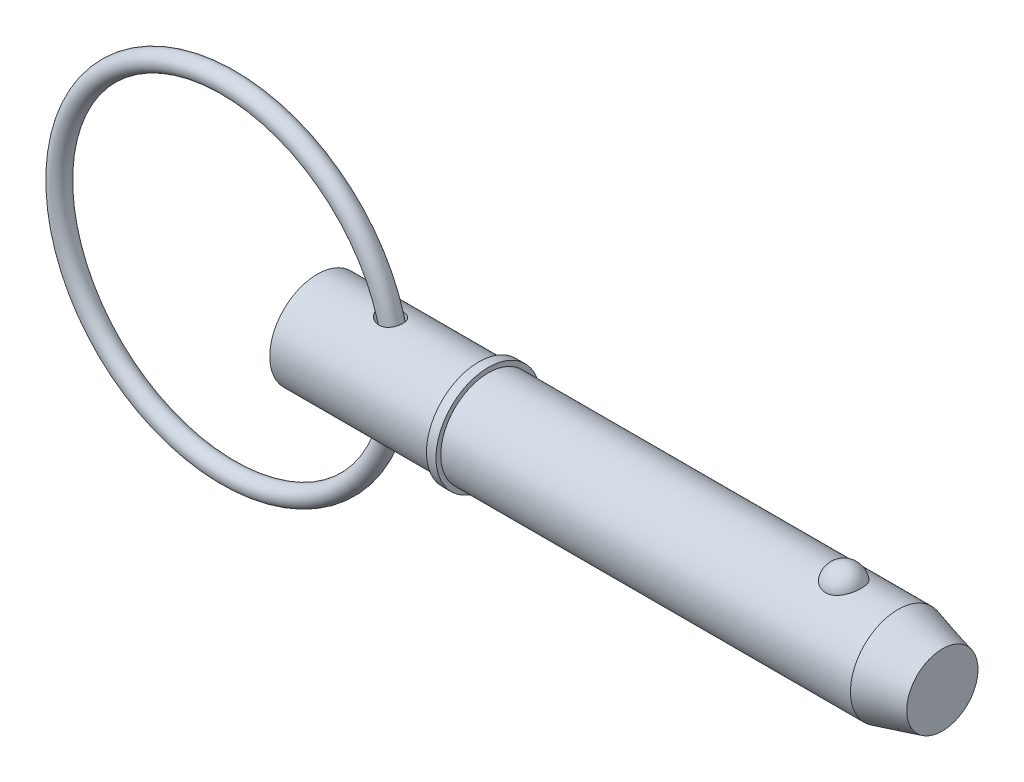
ISO-10303-21;
HEADER;
FILE_DESCRIPTION(('STEP AP214'),'2;1');
FILE_NAME('part.step','',(''),(''),'','','');
FILE_SCHEMA(('AUTOMOTIVE_DESIGN { 1 0 10303 214 1 1 1 1 }'));
ENDSEC;
DATA;
#1=APPLICATION_CONTEXT('core data for automotive mechanical design processes');
#2=APPLICATION_PROTOCOL_DEFINITION('international standard','automotive_design',2000,#1);
#3=PRODUCT_CONTEXT('',#1,'mechanical');
#4=PRODUCT('Part','Part','',(#3));
#5=PRODUCT_RELATED_PRODUCT_CATEGORY('part','',(#4));
#6=PRODUCT_DEFINITION_FORMATION('','',#4);
#7=PRODUCT_DEFINITION_CONTEXT('part definition',#1,'design');
#8=PRODUCT_DEFINITION('design','',#6,#7);
#9=PRODUCT_DEFINITION_SHAPE('','',#8);
#10=(LENGTH_UNIT() NAMED_UNIT(*) SI_UNIT(.MILLI.,.METRE.));
#11=(NAMED_UNIT(*) PLANE_ANGLE_UNIT() SI_UNIT($,.RADIAN.));
#12=(NAMED_UNIT(*) SI_UNIT($,.STERADIAN.) SOLID_ANGLE_UNIT());
#13=UNCERTAINTY_MEASURE_WITH_UNIT(LENGTH_MEASURE(1.E-05),#10,'distance_accuracy_value','');
#14=(GEOMETRIC_REPRESENTATION_CONTEXT(3) GLOBAL_UNCERTAINTY_ASSIGNED_CONTEXT((#13)) GLOBAL_UNIT_ASSIGNED_CONTEXT((#10,
#11,#12)) REPRESENTATION_CONTEXT('',''));
#15=CARTESIAN_POINT('',(0.,0.,0.));
#16=DIRECTION('',(0.,0.,1.));
#17=DIRECTION('',(1.,0.,0.));
#18=AXIS2_PLACEMENT_3D('',#15,#16,#17);
#19=CARTESIAN_POINT('',(-13.3805387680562,0.,0.));
#20=DIRECTION('',(0.,0.,1.));
#21=DIRECTION('',(1.,0.,0.));
#22=AXIS2_PLACEMENT_3D('',#19,#20,#21);
#23=TOROIDAL_SURFACE('',#22,25.4,1.429);
#24=CARTESIAN_POINT('',(13.4484612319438,0.,0.));
#25=VERTEX_POINT('',#24);
#26=VERTEX_LOOP('',#25);
#27=FACE_BOUND('',#26,.T.);
#28=ADVANCED_FACE('P0_F12',(#27),#23,.T.);
#29=CLOSED_SHELL('',(#28));
#30=MANIFOLD_SOLID_BREP('P0_B1',#29);
#31=CARTESIAN_POINT('',(0.,0.,0.));
#32=DIRECTION('',(1.,0.,0.));
#33=DIRECTION('',(0.,0.,-1.));
#34=AXIS2_PLACEMENT_3D('',#31,#32,#33);
#35=CYLINDRICAL_SURFACE('',#34,7.145);
#36=CARTESIAN_POINT('',(9.43029029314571,7.0820748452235,-0.946171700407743));
#37=CARTESIAN_POINT('',(9.49289741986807,7.07004660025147,-1.03619677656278));
#38=CARTESIAN_POINT('',(9.56370593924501,7.05703049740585,-1.12049617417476));
#39=CARTESIAN_POINT('',(9.71869321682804,7.03060933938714,-1.27585605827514));
#40=CARTESIAN_POINT('',(9.80290151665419,7.01720347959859,-1.34688652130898));
#41=CARTESIAN_POINT('',(9.98160385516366,6.99158714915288,-1.47408585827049));
#42=CARTESIAN_POINT('',(10.0760626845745,6.97937284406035,-1.53030346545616));
#43=CARTESIAN_POINT('',(10.2729508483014,6.95747410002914,-1.62697341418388));
#44=CARTESIAN_POINT('',(10.3753769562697,6.9477886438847,-1.66743209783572));
#45=CARTESIAN_POINT('',(10.5898946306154,6.93181594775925,-1.73266776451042));
#46=CARTESIAN_POINT('',(10.7022085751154,6.92567913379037,-1.75675727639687));
#47=CARTESIAN_POINT('',(10.9294935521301,6.91839634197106,-1.78523005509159));
#48=CARTESIAN_POINT('',(11.0444638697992,6.91724903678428,-1.78961856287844));
#49=CARTESIAN_POINT('',(11.2673249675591,6.92023954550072,-1.77801517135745));
#50=CARTESIAN_POINT('',(11.3752729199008,6.9241055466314,-1.7630715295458));
#51=CARTESIAN_POINT('',(11.5865707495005,6.93632220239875,-1.71437618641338));
#52=CARTESIAN_POINT('',(11.6899227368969,6.94467077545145,-1.68063321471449));
#53=CARTESIAN_POINT('',(11.8814537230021,6.96412118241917,-1.59802791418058));
#54=CARTESIAN_POINT('',(11.9701885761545,6.97498839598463,-1.55039425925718));
#55=CARTESIAN_POINT('',(12.1379548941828,6.99847346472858,-1.44066970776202));
#56=CARTESIAN_POINT('',(12.216987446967,7.01109112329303,-1.37858043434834));
#57=CARTESIAN_POINT('',(12.3614636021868,7.03632910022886,-1.24326778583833));
#58=CARTESIAN_POINT('',(12.4271729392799,7.04894297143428,-1.17032635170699));
#59=CARTESIAN_POINT('',(12.5455377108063,7.07306867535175,-1.01436746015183));
#60=CARTESIAN_POINT('',(12.5981928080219,7.08458047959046,-0.931349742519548));
#61=CARTESIAN_POINT('',(12.6896059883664,7.10535787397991,-0.75677050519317));
#62=CARTESIAN_POINT('',(12.7282356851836,7.11460247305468,-0.665139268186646));
#63=CARTESIAN_POINT('',(12.7900431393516,7.12971795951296,-0.476541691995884));
#64=CARTESIAN_POINT('',(12.8132203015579,7.13558871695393,-0.379575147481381));
#65=CARTESIAN_POINT('',(12.843715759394,7.14336270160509,-0.182249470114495));
#66=CARTESIAN_POINT('',(12.8509095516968,7.14523477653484,-0.0818698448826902));
#67=CARTESIAN_POINT('',(12.8489064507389,7.14471772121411,0.11871563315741));
#68=CARTESIAN_POINT('',(12.8397092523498,7.14232851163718,0.218921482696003));
#69=CARTESIAN_POINT('',(12.8051110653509,7.13353949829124,0.416446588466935));
#70=CARTESIAN_POINT('',(12.7796895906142,7.12713462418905,0.51376203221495));
#71=CARTESIAN_POINT('',(12.7132079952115,7.1110024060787,0.702607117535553));
#72=CARTESIAN_POINT('',(12.6721476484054,7.10127501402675,0.794136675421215));
#73=CARTESIAN_POINT('',(12.5754142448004,7.07957648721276,0.9686879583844));
#74=CARTESIAN_POINT('',(12.5197583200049,7.06760798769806,1.05171950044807));
#75=CARTESIAN_POINT('',(12.3951873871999,7.04275315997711,1.20699878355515));
#76=CARTESIAN_POINT('',(12.3262733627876,7.02986689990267,1.27924732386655));
#77=CARTESIAN_POINT('',(12.1775943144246,7.00473797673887,1.41035599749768));
#78=CARTESIAN_POINT('',(12.0979195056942,6.99249102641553,1.46931758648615));
#79=CARTESIAN_POINT('',(11.9295314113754,6.96991222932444,1.57295053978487));
#80=CARTESIAN_POINT('',(11.840819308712,6.9595801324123,1.61762377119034));
#81=CARTESIAN_POINT('',(11.6577653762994,6.94204625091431,1.69128599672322));
#82=CARTESIAN_POINT('',(11.5634812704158,6.93481718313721,1.72041226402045));
#83=CARTESIAN_POINT('',(11.3712731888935,6.92407027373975,1.76316901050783));
#84=CARTESIAN_POINT('',(11.2733489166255,6.92055273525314,1.7767982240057));
#85=CARTESIAN_POINT('',(11.0745092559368,6.91745053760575,1.78883853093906));
#86=CARTESIAN_POINT('',(10.9735737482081,6.91794816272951,1.7869312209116));
#87=CARTESIAN_POINT('',(10.7732766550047,6.92286647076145,1.76777696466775));
#88=CARTESIAN_POINT('',(10.6739155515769,6.92728833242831,1.75052540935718));
#89=CARTESIAN_POINT('',(10.4726907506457,6.93987626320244,1.69995986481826));
#90=CARTESIAN_POINT('',(10.3710860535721,6.94826759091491,1.66567223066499));
#91=CARTESIAN_POINT('',(10.1746512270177,6.96783543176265,1.5818155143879));
#92=CARTESIAN_POINT('',(10.0798244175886,6.97901329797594,1.53223900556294));
#93=CARTESIAN_POINT('',(9.89353725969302,7.00369413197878,1.41530336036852));
#94=CARTESIAN_POINT('',(9.80266896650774,7.01729943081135,1.34701798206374));
#95=CARTESIAN_POINT('',(9.63408859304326,7.0446567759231,1.19571433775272));
#96=CARTESIAN_POINT('',(9.55637809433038,7.05840883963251,1.11269430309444));
#97=CARTESIAN_POINT('',(9.41909992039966,7.083998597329,0.935821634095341));
#98=CARTESIAN_POINT('',(9.3591283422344,7.09587546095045,0.842290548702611));
#99=CARTESIAN_POINT('',(9.25811978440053,7.11649414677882,0.645207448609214));
#100=CARTESIAN_POINT('',(9.2170578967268,7.12524008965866,0.541668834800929));
#101=CARTESIAN_POINT('',(9.16044503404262,7.13745944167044,0.341322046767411));
#102=CARTESIAN_POINT('',(9.14237352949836,7.14144984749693,0.24525723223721));
#103=CARTESIAN_POINT('',(9.12416132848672,7.14547143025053,0.0513577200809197));
#104=CARTESIAN_POINT('',(9.12401221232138,7.14550446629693,-0.0464761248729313));
#105=CARTESIAN_POINT('',(9.14075660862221,7.14180686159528,-0.230866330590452));
#106=CARTESIAN_POINT('',(9.15598246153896,7.13844450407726,-0.317588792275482));
#107=CARTESIAN_POINT('',(9.20015637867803,7.1288735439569,-0.487231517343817));
#108=CARTESIAN_POINT('',(9.22909411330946,7.12266708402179,-0.570154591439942));
#109=CARTESIAN_POINT('',(9.2869632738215,7.11060500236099,-0.702183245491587));
#110=CARTESIAN_POINT('',(9.31233771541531,7.10538970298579,-0.752949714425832));
#111=CARTESIAN_POINT('',(9.36784352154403,7.09422889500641,-0.85170964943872));
#112=CARTESIAN_POINT('',(9.39797435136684,7.08828346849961,-0.899703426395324));
#113=CARTESIAN_POINT('',(9.43029029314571,7.0820748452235,-0.946171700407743));
#114=B_SPLINE_CURVE_WITH_KNOTS('',3,(#36,#37,#38,#39,#40,#41,#42,#43,#44,#45,#46,#47,#48,#49,
#50,#51,#52,#53,#54,#55,#56,#57,#58,#59,#60,#61,#62,#63,#64,#65,#66,#67,#68,#69,#70,#71,#72,#73,
#74,#75,#76,#77,#78,#79,#80,#81,#82,#83,#84,#85,#86,#87,#88,#89,#90,#91,#92,#93,#94,#95,#96,#97,
#98,#99,#100,#101,#102,#103,#104,#105,#106,#107,#108,#109,#110,#111,#112,#113),.UNSPECIFIED.,
.T.,.F.,(4,2,2,2,2,2,2,2,2,2,2,2,2,2,2,2,2,2,2,2,2,2,2,2,2,2,2,2,2,2,2,2,2,2,2,2,2,2,4),(0.,
0.330712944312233,0.662165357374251,0.992513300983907,1.32272815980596,1.66607248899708,
2.00932547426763,2.33472339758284,2.65997034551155,2.96236844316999,3.26473260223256,
3.56029376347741,3.85586255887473,4.15407251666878,4.45229395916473,4.75283038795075,
5.05337241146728,5.35429467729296,5.6552212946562,5.95579625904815,6.25634893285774,
6.55452242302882,6.85265693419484,7.14811357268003,7.44359434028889,7.74514565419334,
8.04678757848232,8.368090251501,8.68954924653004,9.03133562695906,9.37316306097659,
9.70647113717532,10.0393389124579,10.3311793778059,10.6228827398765,10.8860177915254,
11.1489549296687,11.3196783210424,11.4903825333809),.UNSPECIFIED.);
#115=CARTESIAN_POINT('',(9.43029029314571,7.0820748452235,-0.946171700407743));
#116=VERTEX_POINT('',#115);
#117=EDGE_CURVE('P1_E42',#116,#116,#114,.T.);
#118=ORIENTED_EDGE('',*,*,#117,.T.);
#119=EDGE_LOOP('',(#118));
#120=FACE_BOUND('',#119,.T.);
#121=CARTESIAN_POINT('',(0.,0.,0.));
#122=DIRECTION('',(1.,0.,0.));
#123=DIRECTION('',(0.,0.,-1.));
#124=AXIS2_PLACEMENT_3D('',#121,#122,#123);
#125=CIRCLE('',#124,7.145);
#126=CARTESIAN_POINT('',(0.,0.,-7.145));
#127=VERTEX_POINT('',#126);
#128=EDGE_CURVE('P1_E9',#127,#127,#125,.T.);
#129=ORIENTED_EDGE('',*,*,#128,.T.);
#130=EDGE_LOOP('',(#129));
#131=FACE_BOUND('',#130,.T.);
#132=CARTESIAN_POINT('',(24.271,0.,0.));
#133=DIRECTION('',(1.,0.,0.));
#134=DIRECTION('',(0.,0.,-1.));
#135=AXIS2_PLACEMENT_3D('',#132,#133,#134);
#136=CIRCLE('',#135,7.145);
#137=CARTESIAN_POINT('',(24.271,0.,-7.145));
#138=VERTEX_POINT('',#137);
#139=EDGE_CURVE('P1_E25',#138,#138,#136,.T.);
#140=ORIENTED_EDGE('',*,*,#139,.F.);
#141=EDGE_LOOP('',(#140));
#142=FACE_BOUND('',#141,.T.);
#143=CARTESIAN_POINT('',(9.43029029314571,-7.0820748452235,-0.946171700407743));
#144=CARTESIAN_POINT('',(9.37760063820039,-7.09219753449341,-0.870403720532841));
#145=CARTESIAN_POINT('',(9.33068640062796,-7.10162619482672,-0.790535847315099));
#146=CARTESIAN_POINT('',(9.25028000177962,-7.11818229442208,-0.624083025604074));
#147=CARTESIAN_POINT('',(9.21677847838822,-7.12531133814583,-0.537502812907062));
#148=CARTESIAN_POINT('',(9.16475883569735,-7.13651886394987,-0.359324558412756));
#149=CARTESIAN_POINT('',(9.14630423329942,-7.14058440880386,-0.267706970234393));
#150=CARTESIAN_POINT('',(9.12573334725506,-7.14512216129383,-0.0825612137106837));
#151=CARTESIAN_POINT('',(9.12361335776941,-7.1455951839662,0.0109665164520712));
#152=CARTESIAN_POINT('',(9.13548667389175,-7.14296952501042,0.191627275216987));
#153=CARTESIAN_POINT('',(9.14858103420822,-7.14007009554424,0.278824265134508));
#154=CARTESIAN_POINT('',(9.18869656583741,-7.1313430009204,0.449782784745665));
#155=CARTESIAN_POINT('',(9.21571947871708,-7.1255149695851,0.533543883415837));
#156=CARTESIAN_POINT('',(9.282939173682,-7.11140544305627,0.696984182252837));
#157=CARTESIAN_POINT('',(9.32334793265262,-7.10308469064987,0.7765721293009));
#158=CARTESIAN_POINT('',(9.41555290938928,-7.08481187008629,0.928623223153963));
#159=CARTESIAN_POINT('',(9.4673531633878,-7.07485922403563,1.00108383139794));
#160=CARTESIAN_POINT('',(9.58690514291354,-7.05302654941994,1.14530893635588));
#161=CARTESIAN_POINT('',(9.65578345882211,-7.04105486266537,1.21612477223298));
#162=CARTESIAN_POINT('',(9.80342908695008,-7.01727063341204,1.34660507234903));
#163=CARTESIAN_POINT('',(9.88220203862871,-7.00545818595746,1.40626312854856));
#164=CARTESIAN_POINT('',(10.0573217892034,-6.98177399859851,1.51973713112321));
#165=CARTESIAN_POINT('',(10.1546474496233,-6.9700532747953,1.57208037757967));
#166=CARTESIAN_POINT('',(10.3567277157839,-6.94950828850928,1.66055104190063));
#167=CARTESIAN_POINT('',(10.4614845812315,-6.94068491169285,1.69667350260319));
#168=CARTESIAN_POINT('',(10.6792116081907,-6.92685379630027,1.75230777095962));
#169=CARTESIAN_POINT('',(10.7923373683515,-6.92197732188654,1.77125049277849));
#170=CARTESIAN_POINT('',(11.0202699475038,-6.91736328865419,1.78919210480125));
#171=CARTESIAN_POINT('',(11.1350759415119,-6.91762328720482,1.78820047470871));
#172=CARTESIAN_POINT('',(11.355627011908,-6.92328130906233,1.76615765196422));
#173=CARTESIAN_POINT('',(11.4615007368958,-6.92836826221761,1.74632083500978));
#174=CARTESIAN_POINT('',(11.6678083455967,-6.94272508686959,1.68833625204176));
#175=CARTESIAN_POINT('',(11.7682443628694,-6.9519933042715,1.65019572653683));
#176=CARTESIAN_POINT('',(11.9539217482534,-6.97285816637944,1.55957439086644));
#177=CARTESIAN_POINT('',(12.0397280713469,-6.98426147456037,1.50820229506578));
#178=CARTESIAN_POINT('',(12.2011249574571,-7.00842344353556,1.39160266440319));
#179=CARTESIAN_POINT('',(12.276716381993,-7.0211819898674,1.32637629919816));
#180=CARTESIAN_POINT('',(12.4144868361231,-7.04639315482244,1.18508369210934));
#181=CARTESIAN_POINT('',(12.4768620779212,-7.05884739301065,1.10920872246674));
#182=CARTESIAN_POINT('',(12.5881779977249,-7.08230185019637,0.947973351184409));
#183=CARTESIAN_POINT('',(12.6371182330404,-7.09330202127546,0.862612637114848));
#184=CARTESIAN_POINT('',(12.7208404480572,-7.11277016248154,0.68387168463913));
#185=CARTESIAN_POINT('',(12.7554736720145,-7.12121129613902,0.590418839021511));
#186=CARTESIAN_POINT('',(12.8090653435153,-7.13450309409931,0.398877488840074));
#187=CARTESIAN_POINT('',(12.8280232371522,-7.13935363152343,0.300788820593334));
#188=CARTESIAN_POINT('',(12.8499077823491,-7.14496695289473,0.102058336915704));
#189=CARTESIAN_POINT('',(12.8527265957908,-7.14570223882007,0.00140385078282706));
#190=CARTESIAN_POINT('',(12.8419792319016,-7.14293198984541,-0.198968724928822));
#191=CARTESIAN_POINT('',(12.8284127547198,-7.13942637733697,-0.298686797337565));
#192=CARTESIAN_POINT('',(12.7851853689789,-7.12854635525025,-0.494442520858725));
#193=CARTESIAN_POINT('',(12.7555107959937,-7.12116866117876,-0.590476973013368));
#194=CARTESIAN_POINT('',(12.6807437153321,-7.10334272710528,-0.776042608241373));
#195=CARTESIAN_POINT('',(12.6356510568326,-7.09289445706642,-0.865573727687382));
#196=CARTESIAN_POINT('',(12.5312128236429,-7.07009703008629,-1.03541867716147));
#197=CARTESIAN_POINT('',(12.4718917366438,-7.0577511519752,-1.11574799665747));
#198=CARTESIAN_POINT('',(12.3404461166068,-7.03252701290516,-1.26504204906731));
#199=CARTESIAN_POINT('',(12.2683227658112,-7.01964880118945,-1.3340078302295));
#200=CARTESIAN_POINT('',(12.1139052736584,-6.99493588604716,-1.45803732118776));
#201=CARTESIAN_POINT('',(12.031708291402,-6.98309284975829,-1.51322032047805));
#202=CARTESIAN_POINT('',(11.858962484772,-6.96164945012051,-1.60900039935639));
#203=CARTESIAN_POINT('',(11.7684146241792,-6.95204882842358,-1.6495991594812));
#204=CARTESIAN_POINT('',(11.5822744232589,-6.93618392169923,-1.71508374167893));
#205=CARTESIAN_POINT('',(11.4867225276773,-6.92989640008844,-1.74007923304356));
#206=CARTESIAN_POINT('',(11.292703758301,-6.92114809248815,-1.77455680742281));
#207=CARTESIAN_POINT('',(11.1942365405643,-6.91868775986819,-1.7840370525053));
#208=CARTESIAN_POINT('',(10.9943797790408,-6.91771041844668,-1.78782317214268));
#209=CARTESIAN_POINT('',(10.8929824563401,-6.9193005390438,-1.78171679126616));
#210=CARTESIAN_POINT('',(10.6924353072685,-6.92632816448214,-1.75419409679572));
#211=CARTESIAN_POINT('',(10.5932861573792,-6.93176681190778,-1.73277323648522));
#212=CARTESIAN_POINT('',(10.3927770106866,-6.94630717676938,-1.67356884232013));
#213=CARTESIAN_POINT('',(10.2917367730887,-6.95563581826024,-1.63475796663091));
#214=CARTESIAN_POINT('',(10.0971768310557,-6.97681957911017,-1.54184188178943));
#215=CARTESIAN_POINT('',(10.0036623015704,-6.9886764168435,-1.48772626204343));
#216=CARTESIAN_POINT('',(9.82098935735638,-7.01440230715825,-1.36146688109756));
#217=CARTESIAN_POINT('',(9.73247440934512,-7.0283510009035,-1.28840361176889));
#218=CARTESIAN_POINT('',(9.56978695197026,-7.05591334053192,-1.12770855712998));
#219=CARTESIAN_POINT('',(9.49560170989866,-7.06952727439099,-1.0400898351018));
#220=CARTESIAN_POINT('',(9.43029029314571,-7.0820748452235,-0.946171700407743));
#221=B_SPLINE_CURVE_WITH_KNOTS('',3,(#143,#144,#145,#146,#147,#148,#149,#150,#151,#152,#153,
#154,#155,#156,#157,#158,#159,#160,#161,#162,#163,#164,#165,#166,#167,#168,#169,#170,#171,#172,
#173,#174,#175,#176,#177,#178,#179,#180,#181,#182,#183,#184,#185,#186,#187,#188,#189,#190,#191,
#192,#193,#194,#195,#196,#197,#198,#199,#200,#201,#202,#203,#204,#205,#206,#207,#208,#209,#210,
#211,#212,#213,#214,#215,#216,#217,#218,#219,#220),.UNSPECIFIED.,.T.,.F.,(4,2,2,2,2,2,2,2,2,2,2,
2,2,2,2,2,2,2,2,2,2,2,2,2,2,2,2,2,2,2,2,2,2,2,2,2,2,2,4),(0.,0.278197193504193,
0.556199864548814,0.835370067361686,1.11447693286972,1.37789669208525,1.64134939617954,
1.9091912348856,2.17712812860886,2.4744625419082,2.77196719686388,3.10386520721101,
3.43586457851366,3.77849767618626,4.1209678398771,4.44276705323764,4.76443907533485,
5.06494526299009,5.36542609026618,5.6610728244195,5.95672929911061,6.25538683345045,
6.5540549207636,6.85471634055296,7.15538326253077,7.45630563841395,7.75723095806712,
8.05764204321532,8.35802540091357,8.65571107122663,8.95336242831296,9.24889743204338,
9.54446744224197,9.84793560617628,10.1514939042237,10.4760045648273,10.8007364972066,
11.1458836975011,11.4907227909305),.UNSPECIFIED.);
#222=CARTESIAN_POINT('',(9.43029029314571,-7.0820748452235,-0.946171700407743));
#223=VERTEX_POINT('',#222);
#224=EDGE_CURVE('P1_E17',#223,#223,#221,.T.);
#225=ORIENTED_EDGE('',*,*,#224,.T.);
#226=EDGE_LOOP('',(#225));
#227=FACE_BOUND('',#226,.T.);
#228=ADVANCED_FACE('P1_F13',(#120,#131,#142,#227),#35,.T.);
#229=CARTESIAN_POINT('',(0.,0.,0.));
#230=DIRECTION('',(1.,0.,0.));
#231=DIRECTION('',(0.,0.,-1.));
#232=AXIS2_PLACEMENT_3D('',#229,#230,#231);
#233=CYLINDRICAL_SURFACE('',#232,7.145);
#234=CARTESIAN_POINT('',(87.2836242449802,0.,0.));
#235=DIRECTION('',(1.,0.,0.));
#236=DIRECTION('',(0.,0.,-1.));
#237=AXIS2_PLACEMENT_3D('',#234,#235,#236);
#238=CIRCLE('',#237,7.145);
#239=CARTESIAN_POINT('',(87.2836242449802,0.,-7.145));
#240=VERTEX_POINT('',#239);
#241=EDGE_CURVE('P1_E99',#240,#240,#238,.T.);
#242=ORIENTED_EDGE('',*,*,#241,.F.);
#243=EDGE_LOOP('',(#242));
#244=FACE_BOUND('',#243,.T.);
#245=CARTESIAN_POINT('',(25.7,0.,0.));
#246=DIRECTION('',(1.,0.,0.));
#247=DIRECTION('',(0.,0.,-1.));
#248=AXIS2_PLACEMENT_3D('',#245,#246,#247);
#249=CIRCLE('',#248,7.145);
#250=CARTESIAN_POINT('',(25.7,0.,-7.145));
#251=VERTEX_POINT('',#250);
#252=EDGE_CURVE('P1_E96',#251,#251,#249,.T.);
#253=ORIENTED_EDGE('',*,*,#252,.T.);
#254=EDGE_LOOP('',(#253));
#255=FACE_BOUND('',#254,.T.);
#256=CARTESIAN_POINT('',(79.1395037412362,6.6032862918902,2.72903557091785));
#257=CARTESIAN_POINT('',(78.998315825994,6.60329644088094,2.72902496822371));
#258=CARTESIAN_POINT('',(78.8568832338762,6.60799490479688,2.71772840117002));
#259=CARTESIAN_POINT('',(78.5779557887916,6.62628236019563,2.67281935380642));
#260=CARTESIAN_POINT('',(78.4404726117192,6.63989534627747,2.63914664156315));
#261=CARTESIAN_POINT('',(78.1738894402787,6.67440775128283,2.55059642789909));
#262=CARTESIAN_POINT('',(78.0447683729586,6.69528793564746,2.49577486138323));
#263=CARTESIAN_POINT('',(77.7978694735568,6.74205585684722,2.3665179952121));
#264=CARTESIAN_POINT('',(77.6800865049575,6.76794130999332,2.29209163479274));
#265=CARTESIAN_POINT('',(77.4551671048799,6.82286177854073,2.1231293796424));
#266=CARTESIAN_POINT('',(77.3484405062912,6.85196655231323,2.02807107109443));
#267=CARTESIAN_POINT('',(77.1519181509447,6.90970232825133,1.82167822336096));
#268=CARTESIAN_POINT('',(77.062127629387,6.93833318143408,1.71033867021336));
#269=CARTESIAN_POINT('',(76.8976670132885,6.9935167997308,1.46891951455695));
#270=CARTESIAN_POINT('',(76.823844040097,7.01992110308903,1.3382278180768));
#271=CARTESIAN_POINT('',(76.6980884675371,7.06643385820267,1.06566567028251));
#272=CARTESIAN_POINT('',(76.6461573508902,7.08654188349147,0.92379446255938));
#273=CARTESIAN_POINT('',(76.5647323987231,7.11862399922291,0.630993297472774));
#274=CARTESIAN_POINT('',(76.5355167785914,7.13049704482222,0.479974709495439));
#275=CARTESIAN_POINT('',(76.5011742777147,7.14449484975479,0.174782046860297));
#276=CARTESIAN_POINT('',(76.4960466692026,7.14661990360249,0.0206080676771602));
#277=CARTESIAN_POINT('',(76.509938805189,7.14092465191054,-0.285506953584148));
#278=CARTESIAN_POINT('',(76.5288101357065,7.1331654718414,-0.437455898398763));
#279=CARTESIAN_POINT('',(76.5900622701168,7.10859076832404,-0.735778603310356));
#280=CARTESIAN_POINT('',(76.6324435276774,7.0917750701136,-0.882152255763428));
#281=CARTESIAN_POINT('',(76.7399346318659,7.05076716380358,-1.165431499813));
#282=CARTESIAN_POINT('',(76.8050759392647,7.02656475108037,-1.30232366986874));
#283=CARTESIAN_POINT('',(76.9567597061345,6.97329145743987,-1.56265907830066));
#284=CARTESIAN_POINT('',(77.043303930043,6.94422017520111,-1.68610120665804));
#285=CARTESIAN_POINT('',(77.2364654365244,6.88415108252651,-1.91671004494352));
#286=CARTESIAN_POINT('',(77.3431807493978,6.85314438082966,-2.02379244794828));
#287=CARTESIAN_POINT('',(77.5739740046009,6.79282069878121,-2.21787433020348));
#288=CARTESIAN_POINT('',(77.6980505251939,6.76350358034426,-2.30487545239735));
#289=CARTESIAN_POINT('',(77.9576784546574,6.71060580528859,-2.45458647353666));
#290=CARTESIAN_POINT('',(78.0929387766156,6.68691885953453,-2.51776240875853));
#291=CARTESIAN_POINT('',(78.3732778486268,6.64741247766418,-2.6203021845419));
#292=CARTESIAN_POINT('',(78.518352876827,6.63159007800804,-2.65967499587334));
#293=CARTESIAN_POINT('',(78.8063475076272,6.61038594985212,-2.71193301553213));
#294=CARTESIAN_POINT('',(78.9490080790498,6.60451880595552,-2.72605165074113));
#295=CARTESIAN_POINT('',(79.2348004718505,6.60240611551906,-2.73116688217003));
#296=CARTESIAN_POINT('',(79.3779321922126,6.60615862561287,-2.72216814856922));
#297=CARTESIAN_POINT('',(79.6558486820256,6.62256094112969,-2.68200435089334));
#298=CARTESIAN_POINT('',(79.7907542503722,6.63492533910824,-2.65154998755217));
#299=CARTESIAN_POINT('',(80.05332009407,6.66687445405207,-2.5701568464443));
#300=CARTESIAN_POINT('',(80.1809797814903,6.68645975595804,-2.51921640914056));
#301=CARTESIAN_POINT('',(80.4285777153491,6.73127274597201,-2.39693610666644));
#302=CARTESIAN_POINT('',(80.548287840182,6.75661381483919,-2.32517694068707));
#303=CARTESIAN_POINT('',(80.7741592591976,6.8100600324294,-2.16363812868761));
#304=CARTESIAN_POINT('',(80.880317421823,6.83816581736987,-2.07385432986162));
#305=CARTESIAN_POINT('',(81.0818620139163,6.89580469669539,-1.87357235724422));
#306=CARTESIAN_POINT('',(81.176440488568,6.92533863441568,-1.76226074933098));
#307=CARTESIAN_POINT('',(81.3463329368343,6.98139526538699,-1.52511696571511));
#308=CARTESIAN_POINT('',(81.4216434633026,7.0079174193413,-1.39928219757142));
#309=CARTESIAN_POINT('',(81.553595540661,7.05607625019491,-1.1321597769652));
#310=CARTESIAN_POINT('',(81.6095688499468,7.07753119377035,-0.990508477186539));
#311=CARTESIAN_POINT('',(81.6982965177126,7.11222355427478,-0.699154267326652));
#312=CARTESIAN_POINT('',(81.7310506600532,7.12546089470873,-0.549451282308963));
#313=CARTESIAN_POINT('',(81.7726899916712,7.1423758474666,-0.246120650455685));
#314=CARTESIAN_POINT('',(81.781558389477,7.14604673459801,-0.0924903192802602));
#315=CARTESIAN_POINT('',(81.7751940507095,7.14343510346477,0.214181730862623));
#316=CARTESIAN_POINT('',(81.7599618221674,7.13715279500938,0.367223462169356));
#317=CARTESIAN_POINT('',(81.7058451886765,7.1153294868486,0.667595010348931));
#318=CARTESIAN_POINT('',(81.6670776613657,7.09983424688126,0.814949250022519));
#319=CARTESIAN_POINT('',(81.5667700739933,7.06119140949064,1.10063221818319));
#320=CARTESIAN_POINT('',(81.5052284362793,7.03804328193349,1.23896032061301));
#321=CARTESIAN_POINT('',(81.3602071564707,6.98632429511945,1.50352300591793));
#322=CARTESIAN_POINT('',(81.2766067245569,6.95772382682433,1.62968561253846));
#323=CARTESIAN_POINT('',(81.0893804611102,6.89823072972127,1.86554304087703));
#324=CARTESIAN_POINT('',(80.9857557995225,6.86733823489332,1.97523882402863));
#325=CARTESIAN_POINT('',(80.7610769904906,6.80676456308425,2.174822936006));
#326=CARTESIAN_POINT('',(80.6400673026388,6.7770805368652,2.26476035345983));
#327=CARTESIAN_POINT('',(80.3833408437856,6.72230501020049,2.42252989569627));
#328=CARTESIAN_POINT('',(80.2476185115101,6.69721525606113,2.49035362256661));
#329=CARTESIAN_POINT('',(79.9704022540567,6.65552591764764,2.59967646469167));
#330=CARTESIAN_POINT('',(79.8292810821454,6.63865794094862,2.64202017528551));
#331=CARTESIAN_POINT('',(79.5414448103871,6.6142503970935,2.70255841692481));
#332=CARTESIAN_POINT('',(79.3947480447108,6.60668259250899,2.72082606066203));
#333=CARTESIAN_POINT('',(79.2116799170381,6.60358754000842,2.72830331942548));
#334=CARTESIAN_POINT('',(79.1755998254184,6.60328369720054,2.72903828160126));
#335=CARTESIAN_POINT('',(79.1395037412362,6.6032862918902,2.72903557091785));
#336=B_SPLINE_CURVE_WITH_KNOTS('',3,(#256,#257,#258,#259,#260,#261,#262,#263,#264,#265,#266,
#267,#268,#269,#270,#271,#272,#273,#274,#275,#276,#277,#278,#279,#280,#281,#282,#283,#284,#285,
#286,#287,#288,#289,#290,#291,#292,#293,#294,#295,#296,#297,#298,#299,#300,#301,#302,#303,#304,
#305,#306,#307,#308,#309,#310,#311,#312,#313,#314,#315,#316,#317,#318,#319,#320,#321,#322,#323,
#324,#325,#326,#327,#328,#329,#330,#331,#332,#333,#334,#335),.UNSPECIFIED.,.T.,.F.,(4,2,2,2,2,2,
2,2,2,2,2,2,2,2,2,2,2,2,2,2,2,2,2,2,2,2,2,2,2,2,2,2,2,2,2,2,2,2,2,4),(0.,0.423468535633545,
0.848081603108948,1.27157926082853,1.69488414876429,2.13051395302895,2.56627819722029,
3.02136706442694,3.47648674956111,3.93709649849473,4.39769233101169,4.85545355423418,
5.31322361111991,5.77162895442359,6.23007210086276,6.69080337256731,7.15149693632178,
7.6026432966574,8.05361952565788,8.48189729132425,8.91008854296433,9.324725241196,
9.73939553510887,10.1630783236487,10.5868588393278,11.0319070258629,11.4770347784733,
11.9362874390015,12.3955443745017,12.8551240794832,13.3146940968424,13.7720003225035,
14.2293382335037,14.6892343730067,15.1491036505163,15.6078171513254,16.0667046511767,
16.5093965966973,16.9507410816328,17.0590049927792),.UNSPECIFIED.);
#337=CARTESIAN_POINT('',(79.1395037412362,6.6032862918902,2.72903557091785));
#338=VERTEX_POINT('',#337);
#339=EDGE_CURVE('P1_E34',#338,#338,#336,.T.);
#340=ORIENTED_EDGE('',*,*,#339,.T.);
#341=EDGE_LOOP('',(#340));
#342=FACE_BOUND('',#341,.T.);
#343=ADVANCED_FACE('P1_F46',(#244,#255,#342),#233,.T.);
#344=CARTESIAN_POINT('',(0.,0.,0.));
#345=DIRECTION('',(-1.,0.,0.));
#346=DIRECTION('',(0.,0.,1.));
#347=AXIS2_PLACEMENT_3D('',#344,#345,#346);
#348=PLANE('',#347);
#349=ORIENTED_EDGE('',*,*,#128,.F.);
#350=EDGE_LOOP('',(#349));
#351=FACE_BOUND('',#350,.T.);
#352=ADVANCED_FACE('P1_F15',(#351),#348,.T.);
#353=CARTESIAN_POINT('',(24.271,7.145,0.));
#354=DIRECTION('',(-1.,0.,0.));
#355=DIRECTION('',(0.,0.,1.));
#356=AXIS2_PLACEMENT_3D('',#353,#354,#355);
#357=PLANE('',#356);
#358=ORIENTED_EDGE('',*,*,#139,.T.);
#359=EDGE_LOOP('',(#358));
#360=FACE_BOUND('',#359,.T.);
#361=CARTESIAN_POINT('',(24.271,0.,0.));
#362=DIRECTION('',(1.,0.,0.));
#363=DIRECTION('',(0.,0.,-1.));
#364=AXIS2_PLACEMENT_3D('',#361,#362,#363);
#365=CIRCLE('',#364,7.8595);
#366=CARTESIAN_POINT('',(24.271,0.,-7.8595));
#367=VERTEX_POINT('',#366);
#368=EDGE_CURVE('P1_E30',#367,#367,#365,.T.);
#369=ORIENTED_EDGE('',*,*,#368,.F.);
#370=EDGE_LOOP('',(#369));
#371=FACE_BOUND('',#370,.T.);
#372=ADVANCED_FACE('P1_F81',(#360,#371),#357,.T.);
#373=CARTESIAN_POINT('',(0.,0.,0.));
#374=DIRECTION('',(1.,0.,0.));
#375=DIRECTION('',(0.,0.,-1.));
#376=AXIS2_PLACEMENT_3D('',#373,#374,#375);
#377=CYLINDRICAL_SURFACE('',#376,7.8595);
#378=ORIENTED_EDGE('',*,*,#368,.T.);
#379=EDGE_LOOP('',(#378));
#380=FACE_BOUND('',#379,.T.);
#381=CARTESIAN_POINT('',(25.7,0.,0.));
#382=DIRECTION('',(1.,0.,0.));
#383=DIRECTION('',(0.,0.,-1.));
#384=AXIS2_PLACEMENT_3D('',#381,#382,#383);
#385=CIRCLE('',#384,7.8595);
#386=CARTESIAN_POINT('',(25.7,0.,-7.8595));
#387=VERTEX_POINT('',#386);
#388=EDGE_CURVE('P1_E95',#387,#387,#385,.T.);
#389=ORIENTED_EDGE('',*,*,#388,.F.);
#390=EDGE_LOOP('',(#389));
#391=FACE_BOUND('',#390,.T.);
#392=ADVANCED_FACE('P1_F68',(#380,#391),#377,.T.);
#393=CARTESIAN_POINT('',(25.7,7.8595,0.));
#394=DIRECTION('',(1.,0.,0.));
#395=DIRECTION('',(0.,0.,-1.));
#396=AXIS2_PLACEMENT_3D('',#393,#394,#395);
#397=PLANE('',#396);
#398=ORIENTED_EDGE('',*,*,#388,.T.);
#399=EDGE_LOOP('',(#398));
#400=FACE_BOUND('',#399,.T.);
#401=ORIENTED_EDGE('',*,*,#252,.F.);
#402=EDGE_LOOP('',(#401));
#403=FACE_BOUND('',#402,.T.);
#404=ADVANCED_FACE('P1_F62',(#400,#403),#397,.T.);
#405=CARTESIAN_POINT('',(93.95,0.,0.));
#406=DIRECTION('',(-1.,0.,0.));
#407=DIRECTION('',(0.,0.,1.));
#408=AXIS2_PLACEMENT_3D('',#405,#406,#407);
#409=CONICAL_SURFACE('',#408,5.35875000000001,0.26179938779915);
#410=ORIENTED_EDGE('',*,*,#241,.T.);
#411=EDGE_LOOP('',(#410));
#412=FACE_BOUND('',#411,.T.);
#413=CARTESIAN_POINT('',(93.95,0.,0.));
#414=DIRECTION('',(1.,0.,0.));
#415=DIRECTION('',(0.,0.,-1.));
#416=AXIS2_PLACEMENT_3D('',#413,#414,#415);
#417=CIRCLE('',#416,5.35875000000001);
#418=CARTESIAN_POINT('',(93.95,0.,-5.35875000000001));
#419=VERTEX_POINT('',#418);
#420=EDGE_CURVE('P1_E41',#419,#419,#417,.T.);
#421=ORIENTED_EDGE('',*,*,#420,.F.);
#422=EDGE_LOOP('',(#421));
#423=FACE_BOUND('',#422,.T.);
#424=ADVANCED_FACE('P1_F59',(#412,#423),#409,.T.);
#425=CARTESIAN_POINT('',(93.95,5.35875000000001,0.));
#426=DIRECTION('',(1.,0.,0.));
#427=DIRECTION('',(0.,0.,-1.));
#428=AXIS2_PLACEMENT_3D('',#425,#426,#427);
#429=PLANE('',#428);
#430=ORIENTED_EDGE('',*,*,#420,.T.);
#431=EDGE_LOOP('',(#430));
#432=FACE_BOUND('',#431,.T.);
#433=ADVANCED_FACE('P1_F55',(#432),#429,.T.);
#434=CARTESIAN_POINT('',(79.1395037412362,6.4305,0.));
#435=DIRECTION('',(-1.,0.,0.));
#436=DIRECTION('',(0.,-1.,0.));
#437=AXIS2_PLACEMENT_3D('',#434,#435,#436);
#438=SPHERICAL_SURFACE('',#437,2.73450000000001);
#439=ORIENTED_EDGE('',*,*,#339,.F.);
#440=EDGE_LOOP('',(#439));
#441=FACE_BOUND('',#440,.T.);
#442=ADVANCED_FACE('P1_F50',(#441),#438,.T.);
#443=CARTESIAN_POINT('',(-13.3805387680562,0.,0.));
#444=DIRECTION('',(0.,0.,1.));
#445=DIRECTION('',(1.,0.,0.));
#446=AXIS2_PLACEMENT_3D('',#443,#444,#445);
#447=TOROIDAL_SURFACE('',#446,25.4,1.78625);
#448=ORIENTED_EDGE('',*,*,#224,.F.);
#449=EDGE_LOOP('',(#448));
#450=FACE_BOUND('',#449,.T.);
#451=ORIENTED_EDGE('',*,*,#117,.F.);
#452=EDGE_LOOP('',(#451));
#453=FACE_BOUND('',#452,.T.);
#454=ADVANCED_FACE('P1_F54',(#450,#453),#447,.F.);
#455=CLOSED_SHELL('',(#228,#343,#352,#372,#392,#404,#424,#433,#442,#454));
#456=MANIFOLD_SOLID_BREP('P1_B1',#455);
#457=ADVANCED_BREP_SHAPE_REPRESENTATION('',(#18,#30,#456),#14);
#458=SHAPE_DEFINITION_REPRESENTATION(#9,#457);
ENDSEC;
END-ISO-10303-21;
